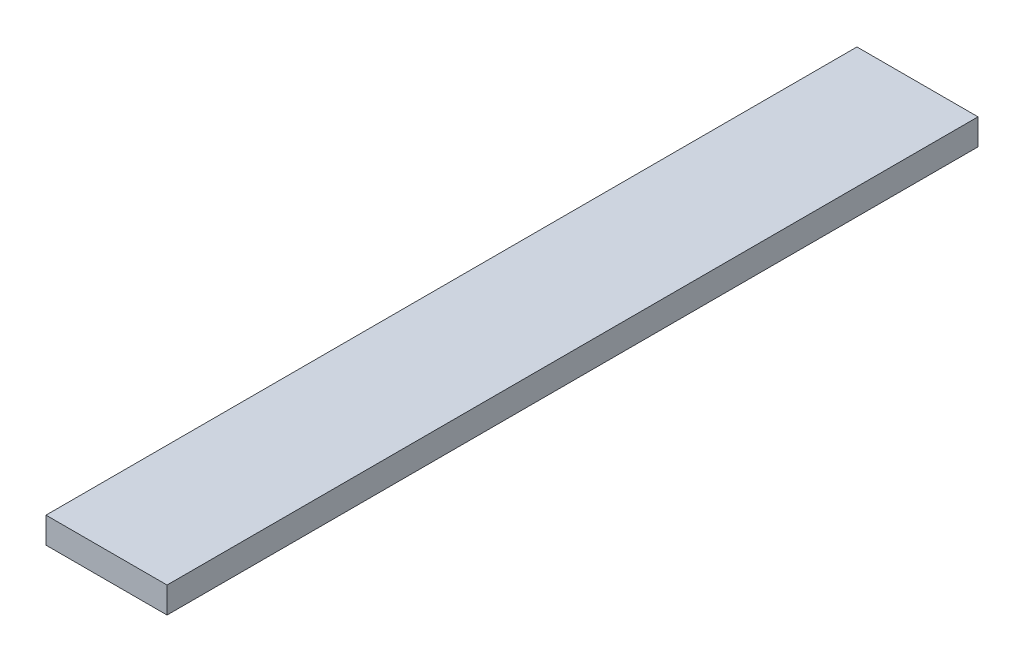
ISO-10303-21;
HEADER;
FILE_DESCRIPTION(('STEP AP214'),'2;1');
FILE_NAME('part.step','',(''),(''),'','','');
FILE_SCHEMA(('AUTOMOTIVE_DESIGN { 1 0 10303 214 1 1 1 1 }'));
ENDSEC;
DATA;
#1=APPLICATION_CONTEXT('core data for automotive mechanical design processes');
#2=APPLICATION_PROTOCOL_DEFINITION('international standard','automotive_design',2000,#1);
#3=PRODUCT_CONTEXT('',#1,'mechanical');
#4=PRODUCT('Part','Part','',(#3));
#5=PRODUCT_RELATED_PRODUCT_CATEGORY('part','',(#4));
#6=PRODUCT_DEFINITION_FORMATION('','',#4);
#7=PRODUCT_DEFINITION_CONTEXT('part definition',#1,'design');
#8=PRODUCT_DEFINITION('design','',#6,#7);
#9=PRODUCT_DEFINITION_SHAPE('','',#8);
#10=(LENGTH_UNIT() NAMED_UNIT(*) SI_UNIT(.MILLI.,.METRE.));
#11=(NAMED_UNIT(*) PLANE_ANGLE_UNIT() SI_UNIT($,.RADIAN.));
#12=(NAMED_UNIT(*) SI_UNIT($,.STERADIAN.) SOLID_ANGLE_UNIT());
#13=UNCERTAINTY_MEASURE_WITH_UNIT(LENGTH_MEASURE(1.E-05),#10,'distance_accuracy_value','');
#14=(GEOMETRIC_REPRESENTATION_CONTEXT(3) GLOBAL_UNCERTAINTY_ASSIGNED_CONTEXT((#13)) GLOBAL_UNIT_ASSIGNED_CONTEXT((#10,
#11,#12)) REPRESENTATION_CONTEXT('',''));
#15=CARTESIAN_POINT('',(0.,0.,0.));
#16=DIRECTION('',(0.,0.,1.));
#17=DIRECTION('',(1.,0.,0.));
#18=AXIS2_PLACEMENT_3D('',#15,#16,#17);
#19=CARTESIAN_POINT('',(295.275,127.,-1978.07072));
#20=DIRECTION('',(-1.,0.,0.));
#21=DIRECTION('',(0.,0.,1.));
#22=AXIS2_PLACEMENT_3D('',#19,#20,#21);
#23=PLANE('',#22);
#24=DIRECTION('',(0.,0.,-1.));
#25=VECTOR('',#24,1.);
#26=CARTESIAN_POINT('',(295.275,0.,-1978.07072));
#27=LINE('',#26,#25);
#28=CARTESIAN_POINT('',(295.275,0.,1978.07072));
#29=VERTEX_POINT('',#28);
#30=CARTESIAN_POINT('',(295.275,0.,-1978.07072));
#31=VERTEX_POINT('',#30);
#32=EDGE_CURVE('E99',#29,#31,#27,.T.);
#33=ORIENTED_EDGE('',*,*,#32,.T.);
#34=DIRECTION('',(0.,-1.,0.));
#35=VECTOR('',#34,1.);
#36=CARTESIAN_POINT('',(295.275,127.,-1978.07072));
#37=LINE('',#36,#35);
#38=CARTESIAN_POINT('',(295.275,127.,-1978.07072));
#39=VERTEX_POINT('',#38);
#40=EDGE_CURVE('E11',#39,#31,#37,.T.);
#41=ORIENTED_EDGE('',*,*,#40,.F.);
#42=DIRECTION('',(0.,0.,-1.));
#43=VECTOR('',#42,1.);
#44=CARTESIAN_POINT('',(295.275,127.,-1978.07072));
#45=LINE('',#44,#43);
#46=CARTESIAN_POINT('',(295.275,127.,1978.07072));
#47=VERTEX_POINT('',#46);
#48=EDGE_CURVE('E85',#47,#39,#45,.T.);
#49=ORIENTED_EDGE('',*,*,#48,.F.);
#50=DIRECTION('',(0.,-1.,0.));
#51=VECTOR('',#50,1.);
#52=CARTESIAN_POINT('',(295.275,127.,1978.07072));
#53=LINE('',#52,#51);
#54=EDGE_CURVE('E95',#47,#29,#53,.T.);
#55=ORIENTED_EDGE('',*,*,#54,.T.);
#56=EDGE_LOOP('',(#33,#41,#49,#55));
#57=FACE_BOUND('',#56,.T.);
#58=ADVANCED_FACE('F34',(#57),#23,.F.);
#59=CARTESIAN_POINT('',(-295.275,127.,-1978.07072));
#60=DIRECTION('',(0.,0.,1.));
#61=DIRECTION('',(1.,0.,0.));
#62=AXIS2_PLACEMENT_3D('',#59,#60,#61);
#63=PLANE('',#62);
#64=DIRECTION('',(-1.,0.,0.));
#65=VECTOR('',#64,1.);
#66=CARTESIAN_POINT('',(-295.275,0.,-1978.07072));
#67=LINE('',#66,#65);
#68=CARTESIAN_POINT('',(-295.275,0.,-1978.07072));
#69=VERTEX_POINT('',#68);
#70=EDGE_CURVE('E89',#31,#69,#67,.T.);
#71=ORIENTED_EDGE('',*,*,#70,.T.);
#72=DIRECTION('',(0.,-1.,0.));
#73=VECTOR('',#72,1.);
#74=CARTESIAN_POINT('',(-295.275,127.,-1978.07072));
#75=LINE('',#74,#73);
#76=CARTESIAN_POINT('',(-295.275,127.,-1978.07072));
#77=VERTEX_POINT('',#76);
#78=EDGE_CURVE('E42',#77,#69,#75,.T.);
#79=ORIENTED_EDGE('',*,*,#78,.F.);
#80=DIRECTION('',(-1.,0.,0.));
#81=VECTOR('',#80,1.);
#82=CARTESIAN_POINT('',(-295.275,127.,-1978.07072));
#83=LINE('',#82,#81);
#84=EDGE_CURVE('E80',#39,#77,#83,.T.);
#85=ORIENTED_EDGE('',*,*,#84,.F.);
#86=ORIENTED_EDGE('',*,*,#40,.T.);
#87=EDGE_LOOP('',(#71,#79,#85,#86));
#88=FACE_BOUND('',#87,.T.);
#89=ADVANCED_FACE('F88',(#88),#63,.F.);
#90=CARTESIAN_POINT('',(-295.275,127.,-1978.07072));
#91=DIRECTION('',(1.,0.,0.));
#92=DIRECTION('',(0.,0.,-1.));
#93=AXIS2_PLACEMENT_3D('',#90,#91,#92);
#94=PLANE('',#93);
#95=DIRECTION('',(0.,0.,1.));
#96=VECTOR('',#95,1.);
#97=CARTESIAN_POINT('',(-295.275,0.,-1978.07072));
#98=LINE('',#97,#96);
#99=CARTESIAN_POINT('',(-295.275,0.,1978.07072));
#100=VERTEX_POINT('',#99);
#101=EDGE_CURVE('E67',#69,#100,#98,.T.);
#102=ORIENTED_EDGE('',*,*,#101,.T.);
#103=DIRECTION('',(0.,-1.,0.));
#104=VECTOR('',#103,1.);
#105=CARTESIAN_POINT('',(-295.275,127.,1978.07072));
#106=LINE('',#105,#104);
#107=CARTESIAN_POINT('',(-295.275,127.,1978.07072));
#108=VERTEX_POINT('',#107);
#109=EDGE_CURVE('E90',#108,#100,#106,.T.);
#110=ORIENTED_EDGE('',*,*,#109,.F.);
#111=DIRECTION('',(0.,0.,1.));
#112=VECTOR('',#111,1.);
#113=CARTESIAN_POINT('',(-295.275,127.,-1978.07072));
#114=LINE('',#113,#112);
#115=EDGE_CURVE('E83',#77,#108,#114,.T.);
#116=ORIENTED_EDGE('',*,*,#115,.F.);
#117=ORIENTED_EDGE('',*,*,#78,.T.);
#118=EDGE_LOOP('',(#102,#110,#116,#117));
#119=FACE_BOUND('',#118,.T.);
#120=ADVANCED_FACE('F91',(#119),#94,.F.);
#121=CARTESIAN_POINT('',(-295.275,127.,1978.07072));
#122=DIRECTION('',(0.,0.,-1.));
#123=DIRECTION('',(-1.,0.,0.));
#124=AXIS2_PLACEMENT_3D('',#121,#122,#123);
#125=PLANE('',#124);
#126=DIRECTION('',(1.,0.,0.));
#127=VECTOR('',#126,1.);
#128=CARTESIAN_POINT('',(-295.275,0.,1978.07072));
#129=LINE('',#128,#127);
#130=EDGE_CURVE('E73',#100,#29,#129,.T.);
#131=ORIENTED_EDGE('',*,*,#130,.T.);
#132=ORIENTED_EDGE('',*,*,#54,.F.);
#133=DIRECTION('',(1.,0.,0.));
#134=VECTOR('',#133,1.);
#135=CARTESIAN_POINT('',(-295.275,127.,1978.07072));
#136=LINE('',#135,#134);
#137=EDGE_CURVE('E50',#108,#47,#136,.T.);
#138=ORIENTED_EDGE('',*,*,#137,.F.);
#139=ORIENTED_EDGE('',*,*,#109,.T.);
#140=EDGE_LOOP('',(#131,#132,#138,#139));
#141=FACE_BOUND('',#140,.T.);
#142=ADVANCED_FACE('F106',(#141),#125,.F.);
#143=CARTESIAN_POINT('',(295.275,127.,1978.07072));
#144=DIRECTION('',(0.,1.,0.));
#145=DIRECTION('',(0.,0.,1.));
#146=AXIS2_PLACEMENT_3D('',#143,#144,#145);
#147=PLANE('',#146);
#148=ORIENTED_EDGE('',*,*,#48,.T.);
#149=ORIENTED_EDGE('',*,*,#84,.T.);
#150=ORIENTED_EDGE('',*,*,#115,.T.);
#151=ORIENTED_EDGE('',*,*,#137,.T.);
#152=EDGE_LOOP('',(#148,#149,#150,#151));
#153=FACE_BOUND('',#152,.T.);
#154=ADVANCED_FACE('F81',(#153),#147,.T.);
#155=CARTESIAN_POINT('',(295.275,0.,1978.07072));
#156=DIRECTION('',(0.,1.,0.));
#157=DIRECTION('',(0.,0.,1.));
#158=AXIS2_PLACEMENT_3D('',#155,#156,#157);
#159=PLANE('',#158);
#160=ORIENTED_EDGE('',*,*,#32,.F.);
#161=ORIENTED_EDGE('',*,*,#130,.F.);
#162=ORIENTED_EDGE('',*,*,#101,.F.);
#163=ORIENTED_EDGE('',*,*,#70,.F.);
#164=EDGE_LOOP('',(#160,#161,#162,#163));
#165=FACE_BOUND('',#164,.T.);
#166=ADVANCED_FACE('F109',(#165),#159,.F.);
#167=CLOSED_SHELL('',(#58,#89,#120,#142,#154,#166));
#168=MANIFOLD_SOLID_BREP('B2',#167);
#169=ADVANCED_BREP_SHAPE_REPRESENTATION('',(#18,#168),#14);
#170=SHAPE_DEFINITION_REPRESENTATION(#9,#169);
ENDSEC;
END-ISO-10303-21;
